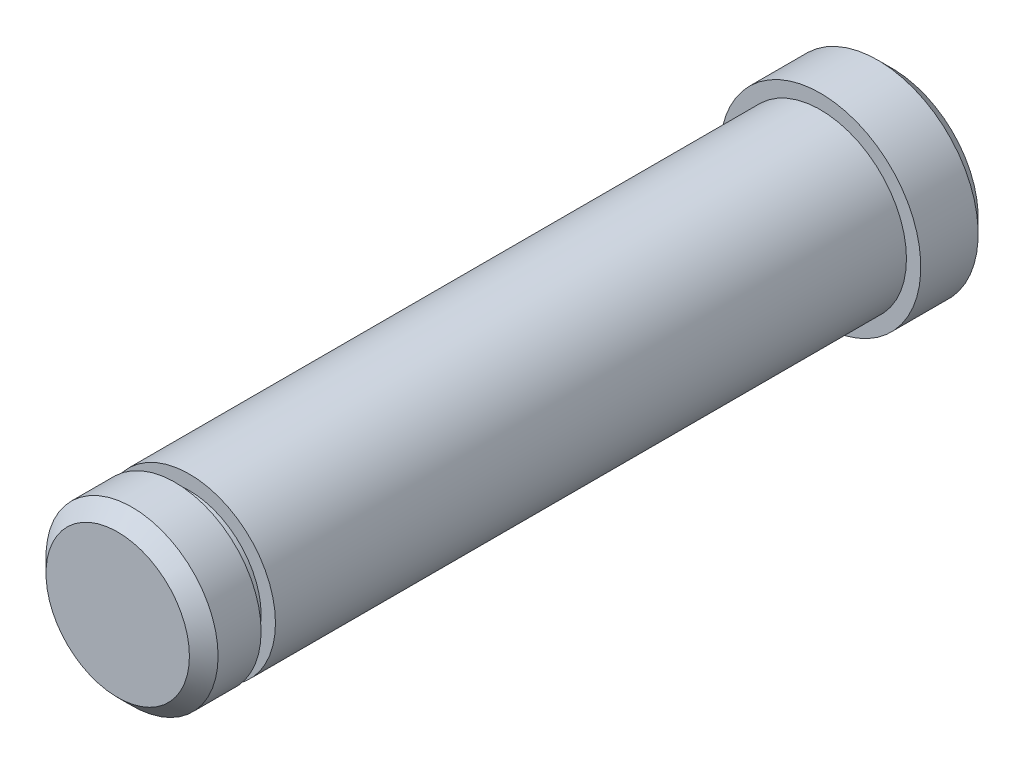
ISO-10303-21;
HEADER;
FILE_DESCRIPTION(('STEP AP214'),'2;1');
FILE_NAME('part.step','',(''),(''),'','','');
FILE_SCHEMA(('AUTOMOTIVE_DESIGN { 1 0 10303 214 1 1 1 1 }'));
ENDSEC;
DATA;
#1=APPLICATION_CONTEXT('core data for automotive mechanical design processes');
#2=APPLICATION_PROTOCOL_DEFINITION('international standard','automotive_design',2000,#1);
#3=PRODUCT_CONTEXT('',#1,'mechanical');
#4=PRODUCT('Part','Part','',(#3));
#5=PRODUCT_RELATED_PRODUCT_CATEGORY('part','',(#4));
#6=PRODUCT_DEFINITION_FORMATION('','',#4);
#7=PRODUCT_DEFINITION_CONTEXT('part definition',#1,'design');
#8=PRODUCT_DEFINITION('design','',#6,#7);
#9=PRODUCT_DEFINITION_SHAPE('','',#8);
#10=(LENGTH_UNIT() NAMED_UNIT(*) SI_UNIT(.MILLI.,.METRE.));
#11=(NAMED_UNIT(*) PLANE_ANGLE_UNIT() SI_UNIT($,.RADIAN.));
#12=(NAMED_UNIT(*) SI_UNIT($,.STERADIAN.) SOLID_ANGLE_UNIT());
#13=UNCERTAINTY_MEASURE_WITH_UNIT(LENGTH_MEASURE(1.E-05),#10,'distance_accuracy_value','');
#14=(GEOMETRIC_REPRESENTATION_CONTEXT(3) GLOBAL_UNCERTAINTY_ASSIGNED_CONTEXT((#13)) GLOBAL_UNIT_ASSIGNED_CONTEXT((#10,
#11,#12)) REPRESENTATION_CONTEXT('',''));
#15=CARTESIAN_POINT('',(0.,0.,0.));
#16=DIRECTION('',(0.,0.,1.));
#17=DIRECTION('',(1.,0.,0.));
#18=AXIS2_PLACEMENT_3D('',#15,#16,#17);
#19=CARTESIAN_POINT('',(0.,0.,44.));
#20=DIRECTION('',(0.,0.,-1.));
#21=DIRECTION('',(-1.,0.,0.));
#22=AXIS2_PLACEMENT_3D('',#19,#20,#21);
#23=CYLINDRICAL_SURFACE('',#22,6.);
#24=CARTESIAN_POINT('',(0.,0.,44.));
#25=DIRECTION('',(0.,0.,1.));
#26=DIRECTION('',(1.,0.,0.));
#27=AXIS2_PLACEMENT_3D('',#24,#25,#26);
#28=CIRCLE('',#27,6.);
#29=CARTESIAN_POINT('',(6.,0.,44.));
#30=VERTEX_POINT('',#29);
#31=EDGE_CURVE('E62',#30,#30,#28,.T.);
#32=ORIENTED_EDGE('',*,*,#31,.F.);
#33=EDGE_LOOP('',(#32));
#34=FACE_BOUND('',#33,.T.);
#35=CARTESIAN_POINT('',(0.,0.,0.));
#36=DIRECTION('',(0.,0.,1.));
#37=DIRECTION('',(1.,0.,0.));
#38=AXIS2_PLACEMENT_3D('',#35,#36,#37);
#39=CIRCLE('',#38,6.);
#40=CARTESIAN_POINT('',(6.,0.,0.));
#41=VERTEX_POINT('',#40);
#42=EDGE_CURVE('E59',#41,#41,#39,.T.);
#43=ORIENTED_EDGE('',*,*,#42,.T.);
#44=EDGE_LOOP('',(#43));
#45=FACE_BOUND('',#44,.T.);
#46=ADVANCED_FACE('F37',(#34,#45),#23,.T.);
#47=CARTESIAN_POINT('',(0.,0.,44.));
#48=DIRECTION('',(0.,0.,1.));
#49=DIRECTION('',(1.,0.,0.));
#50=AXIS2_PLACEMENT_3D('',#47,#48,#49);
#51=PLANE('',#50);
#52=CARTESIAN_POINT('',(0.,0.,44.));
#53=DIRECTION('',(0.,0.,1.));
#54=DIRECTION('',(1.,0.,0.));
#55=AXIS2_PLACEMENT_3D('',#52,#53,#54);
#56=CIRCLE('',#55,5.);
#57=CARTESIAN_POINT('',(5.,0.,44.));
#58=VERTEX_POINT('',#57);
#59=EDGE_CURVE('E58',#58,#58,#56,.T.);
#60=ORIENTED_EDGE('',*,*,#59,.F.);
#61=EDGE_LOOP('',(#60));
#62=FACE_BOUND('',#61,.T.);
#63=ORIENTED_EDGE('',*,*,#31,.T.);
#64=EDGE_LOOP('',(#63));
#65=FACE_BOUND('',#64,.T.);
#66=ADVANCED_FACE('F93',(#62,#65),#51,.T.);
#67=CARTESIAN_POINT('',(0.,0.,-5.));
#68=DIRECTION('',(0.,0.,1.));
#69=DIRECTION('',(1.,0.,0.));
#70=AXIS2_PLACEMENT_3D('',#67,#68,#69);
#71=CYLINDRICAL_SURFACE('',#70,7.);
#72=CARTESIAN_POINT('',(0.,0.,-4.00000000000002));
#73=DIRECTION('',(0.,0.,-1.));
#74=DIRECTION('',(-1.,0.,0.));
#75=AXIS2_PLACEMENT_3D('',#72,#73,#74);
#76=CIRCLE('',#75,7.);
#77=CARTESIAN_POINT('',(-7.,0.,-4.00000000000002));
#78=VERTEX_POINT('',#77);
#79=EDGE_CURVE('E49',#78,#78,#76,.F.);
#80=ORIENTED_EDGE('',*,*,#79,.T.);
#81=EDGE_LOOP('',(#80));
#82=FACE_BOUND('',#81,.T.);
#83=CARTESIAN_POINT('',(0.,0.,0.));
#84=DIRECTION('',(0.,0.,-1.));
#85=DIRECTION('',(-1.,0.,0.));
#86=AXIS2_PLACEMENT_3D('',#83,#84,#85);
#87=CIRCLE('',#86,7.);
#88=CARTESIAN_POINT('',(-7.,0.,0.));
#89=VERTEX_POINT('',#88);
#90=EDGE_CURVE('E63',#89,#89,#87,.T.);
#91=ORIENTED_EDGE('',*,*,#90,.T.);
#92=EDGE_LOOP('',(#91));
#93=FACE_BOUND('',#92,.T.);
#94=ADVANCED_FACE('F99',(#82,#93),#71,.T.);
#95=CARTESIAN_POINT('',(0.,0.,-5.));
#96=DIRECTION('',(0.,0.,-1.));
#97=DIRECTION('',(-1.,0.,0.));
#98=AXIS2_PLACEMENT_3D('',#95,#96,#97);
#99=PLANE('',#98);
#100=CARTESIAN_POINT('',(0.,0.,-5.));
#101=DIRECTION('',(0.,0.,-1.));
#102=DIRECTION('',(-1.,0.,0.));
#103=AXIS2_PLACEMENT_3D('',#100,#101,#102);
#104=CIRCLE('',#103,6.00000000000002);
#105=CARTESIAN_POINT('',(-6.00000000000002,0.,-5.));
#106=VERTEX_POINT('',#105);
#107=EDGE_CURVE('E53',#106,#106,#104,.T.);
#108=ORIENTED_EDGE('',*,*,#107,.T.);
#109=EDGE_LOOP('',(#108));
#110=FACE_BOUND('',#109,.T.);
#111=ADVANCED_FACE('F112',(#110),#99,.T.);
#112=CARTESIAN_POINT('',(0.,0.,0.));
#113=DIRECTION('',(0.,0.,-1.));
#114=DIRECTION('',(-1.,0.,0.));
#115=AXIS2_PLACEMENT_3D('',#112,#113,#114);
#116=PLANE('',#115);
#117=ORIENTED_EDGE('',*,*,#42,.F.);
#118=EDGE_LOOP('',(#117));
#119=FACE_BOUND('',#118,.T.);
#120=ORIENTED_EDGE('',*,*,#90,.F.);
#121=EDGE_LOOP('',(#120));
#122=FACE_BOUND('',#121,.T.);
#123=ADVANCED_FACE('F114',(#119,#122),#116,.F.);
#124=CARTESIAN_POINT('',(0.,0.,45.));
#125=DIRECTION('',(0.,0.,-1.));
#126=DIRECTION('',(-1.,0.,0.));
#127=AXIS2_PLACEMENT_3D('',#124,#125,#126);
#128=CYLINDRICAL_SURFACE('',#127,5.);
#129=CARTESIAN_POINT('',(0.,0.,45.));
#130=DIRECTION('',(0.,0.,1.));
#131=DIRECTION('',(1.,0.,0.));
#132=AXIS2_PLACEMENT_3D('',#129,#130,#131);
#133=CIRCLE('',#132,5.);
#134=CARTESIAN_POINT('',(5.,0.,45.));
#135=VERTEX_POINT('',#134);
#136=EDGE_CURVE('E68',#135,#135,#133,.T.);
#137=ORIENTED_EDGE('',*,*,#136,.F.);
#138=EDGE_LOOP('',(#137));
#139=FACE_BOUND('',#138,.T.);
#140=ORIENTED_EDGE('',*,*,#59,.T.);
#141=EDGE_LOOP('',(#140));
#142=FACE_BOUND('',#141,.T.);
#143=ADVANCED_FACE('F117',(#139,#142),#128,.T.);
#144=CARTESIAN_POINT('',(0.,0.,49.));
#145=DIRECTION('',(0.,0.,-1.));
#146=DIRECTION('',(-1.,0.,0.));
#147=AXIS2_PLACEMENT_3D('',#144,#145,#146);
#148=CYLINDRICAL_SURFACE('',#147,6.);
#149=CARTESIAN_POINT('',(0.,0.,48.));
#150=DIRECTION('',(0.,0.,1.));
#151=DIRECTION('',(1.,0.,0.));
#152=AXIS2_PLACEMENT_3D('',#149,#150,#151);
#153=CIRCLE('',#152,6.);
#154=CARTESIAN_POINT('',(6.,0.,48.));
#155=VERTEX_POINT('',#154);
#156=EDGE_CURVE('E10',#155,#155,#153,.F.);
#157=ORIENTED_EDGE('',*,*,#156,.T.);
#158=EDGE_LOOP('',(#157));
#159=FACE_BOUND('',#158,.T.);
#160=CARTESIAN_POINT('',(0.,0.,45.));
#161=DIRECTION('',(0.,0.,1.));
#162=DIRECTION('',(1.,0.,0.));
#163=AXIS2_PLACEMENT_3D('',#160,#161,#162);
#164=CIRCLE('',#163,6.);
#165=CARTESIAN_POINT('',(6.,0.,45.));
#166=VERTEX_POINT('',#165);
#167=EDGE_CURVE('E73',#166,#166,#164,.T.);
#168=ORIENTED_EDGE('',*,*,#167,.T.);
#169=EDGE_LOOP('',(#168));
#170=FACE_BOUND('',#169,.T.);
#171=ADVANCED_FACE('F77',(#159,#170),#148,.T.);
#172=CARTESIAN_POINT('',(0.,0.,49.));
#173=DIRECTION('',(0.,0.,1.));
#174=DIRECTION('',(1.,0.,0.));
#175=AXIS2_PLACEMENT_3D('',#172,#173,#174);
#176=PLANE('',#175);
#177=CARTESIAN_POINT('',(0.,0.,49.));
#178=DIRECTION('',(0.,0.,1.));
#179=DIRECTION('',(1.,0.,0.));
#180=AXIS2_PLACEMENT_3D('',#177,#178,#179);
#181=CIRCLE('',#180,5.);
#182=CARTESIAN_POINT('',(5.,0.,49.));
#183=VERTEX_POINT('',#182);
#184=EDGE_CURVE('E45',#183,#183,#181,.T.);
#185=ORIENTED_EDGE('',*,*,#184,.T.);
#186=EDGE_LOOP('',(#185));
#187=FACE_BOUND('',#186,.T.);
#188=ADVANCED_FACE('F82',(#187),#176,.T.);
#189=CARTESIAN_POINT('',(0.,0.,45.));
#190=DIRECTION('',(0.,0.,1.));
#191=DIRECTION('',(1.,0.,0.));
#192=AXIS2_PLACEMENT_3D('',#189,#190,#191);
#193=PLANE('',#192);
#194=ORIENTED_EDGE('',*,*,#136,.T.);
#195=EDGE_LOOP('',(#194));
#196=FACE_BOUND('',#195,.T.);
#197=ORIENTED_EDGE('',*,*,#167,.F.);
#198=EDGE_LOOP('',(#197));
#199=FACE_BOUND('',#198,.T.);
#200=ADVANCED_FACE('F79',(#196,#199),#193,.F.);
#201=CARTESIAN_POINT('',(0.,0.,-5.));
#202=DIRECTION('',(0.,0.,1.));
#203=DIRECTION('',(1.,0.,0.));
#204=AXIS2_PLACEMENT_3D('',#201,#202,#203);
#205=CONICAL_SURFACE('',#204,6.00000000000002,0.785398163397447);
#206=ORIENTED_EDGE('',*,*,#79,.F.);
#207=EDGE_LOOP('',(#206));
#208=FACE_BOUND('',#207,.T.);
#209=ORIENTED_EDGE('',*,*,#107,.F.);
#210=EDGE_LOOP('',(#209));
#211=FACE_BOUND('',#210,.T.);
#212=ADVANCED_FACE('F81',(#208,#211),#205,.T.);
#213=CARTESIAN_POINT('',(0.,0.,49.));
#214=DIRECTION('',(0.,0.,-1.));
#215=DIRECTION('',(-1.,0.,0.));
#216=AXIS2_PLACEMENT_3D('',#213,#214,#215);
#217=CONICAL_SURFACE('',#216,5.,0.785398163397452);
#218=ORIENTED_EDGE('',*,*,#156,.F.);
#219=EDGE_LOOP('',(#218));
#220=FACE_BOUND('',#219,.T.);
#221=ORIENTED_EDGE('',*,*,#184,.F.);
#222=EDGE_LOOP('',(#221));
#223=FACE_BOUND('',#222,.T.);
#224=ADVANCED_FACE('F40',(#220,#223),#217,.T.);
#225=CLOSED_SHELL('',(#46,#66,#94,#111,#123,#143,#171,#188,#200,#212,#224));
#226=MANIFOLD_SOLID_BREP('B2',#225);
#227=ADVANCED_BREP_SHAPE_REPRESENTATION('',(#18,#226),#14);
#228=SHAPE_DEFINITION_REPRESENTATION(#9,#227);
ENDSEC;
END-ISO-10303-21;
